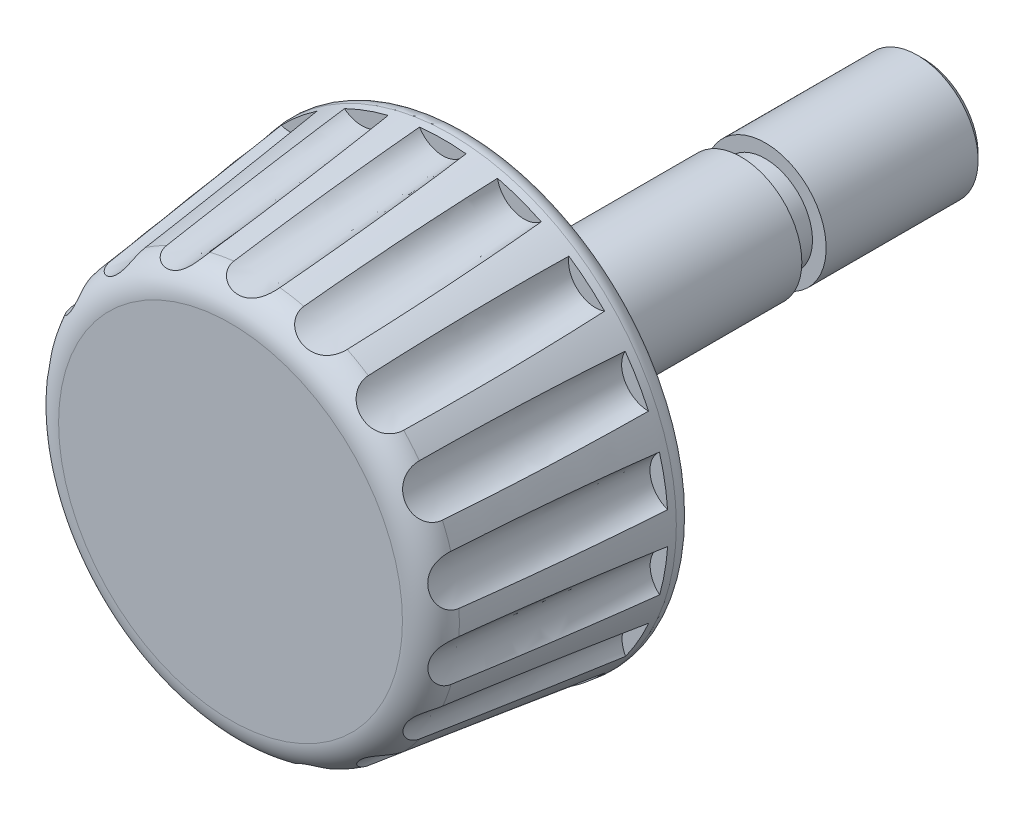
from build123d import *

# Parameters (mm, degrees)
ESQUISSE1_R                  = 7.5
EXTRUSION1_DEPTH             = 7.8
EXTRUSION1_TAPER             = 7
ESQUISSE3_R                  = 2
EXTRUSION3_DEPTH             = 15
CHANFREIN2_SIZE              = 0.2
CONG_1_R                     = 1
ESQUISSE7_R                  = 1.5
ENL_V_MAT_EXTRU_4_DEPTH      = 7
ENL_V_MAT_EXTRU_4_TAPER      = 5
R_P_TITION_CIRCULAIRE1_COUNT = 18
ESQUISSE10_W                 = 1.058649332
ESQUISSE10_H                 = 0.8
CONG_2_R                     = 0.5


with BuildPart() as part:
    # Esquisse1 → Extrusion1 (new body)
    with BuildSketch(Plane.XY):
        Circle(ESQUISSE1_R)
    extrude(amount=EXTRUSION1_DEPTH, taper=EXTRUSION1_TAPER)

    # Esquisse3 → Extrusion3 (add)
    with BuildSketch(Plane(origin=(0, 0, 0), x_dir=(-1, 0, 0), z_dir=(0, 0, -1))):
        with Locations(Location((0, 0, 0), (0, 0, 180))):
            Circle(ESQUISSE3_R)
    extrude(amount=EXTRUSION3_DEPTH)

    # Chanfrein2
    chanfrein2_edges = [part.edges().sort_by_distance(p)[0] for p in [
        (-2, 0, -15),
    ]]
    chamfer(chanfrein2_edges, length=CHANFREIN2_SIZE)

    # Cong_1
    cong_1_edges = [part.edges().sort_by_distance(p)[0] for p in [
        (-6.542280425, 0, 7.8),
    ]]
    fillet(cong_1_edges, radius=CONG_1_R)

    # Esquisse7 → Enl_v. mat.-Extru.4 (cut)
    with BuildSketch(Plane.XY.offset(7.8)):
        with Locations((-0.01365609, 7.810890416)):
            Circle(ESQUISSE7_R)
    enl_v_mat_extru_4 = extrude(amount=-ENL_V_MAT_EXTRU_4_DEPTH, taper=ENL_V_MAT_EXTRU_4_TAPER, mode=Mode.SUBTRACT)

    # R_p_tition circulaire1: Enl_v. mat.-Extru.4 ×18 about axis
    r_p_tition_circulaire1_axis = Axis((0, 0, -15.57), (0, 0, 1))
    for i in range(1, R_P_TITION_CIRCULAIRE1_COUNT):
        add(enl_v_mat_extru_4.rotate(r_p_tition_circulaire1_axis, i * 360 / R_P_TITION_CIRCULAIRE1_COUNT), mode=Mode.SUBTRACT)

    # Esquisse10 → Enl_vement de mati_re-R_volution1 (revolve, cut)
    with BuildSketch(Plane(origin=(0, 0, 0), x_dir=(1, 0, 0), z_dir=(0, 1, 0)), mode=Mode.PRIVATE) as enl_vement_de_mati_re_r_volution1_sk:
        with Locations((-2.079324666, 9.4)):
            Rectangle(ESQUISSE10_W, ESQUISSE10_H)
    revolve(enl_vement_de_mati_re_r_volution1_sk.sketch.rotate(Axis((0, 0, -15.464703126), (0, 0, 1)), 180), axis=Axis((0, 0, -15.464703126), (0, 0, 1)), mode=Mode.SUBTRACT)

    # Cong_2
    cong_2_edges = [part.edges().sort_by_distance(p)[0] for p in [
        (-7.5, 0, 0),
    ]]
    fillet(cong_2_edges, radius=CONG_2_R)


solid = part.part
